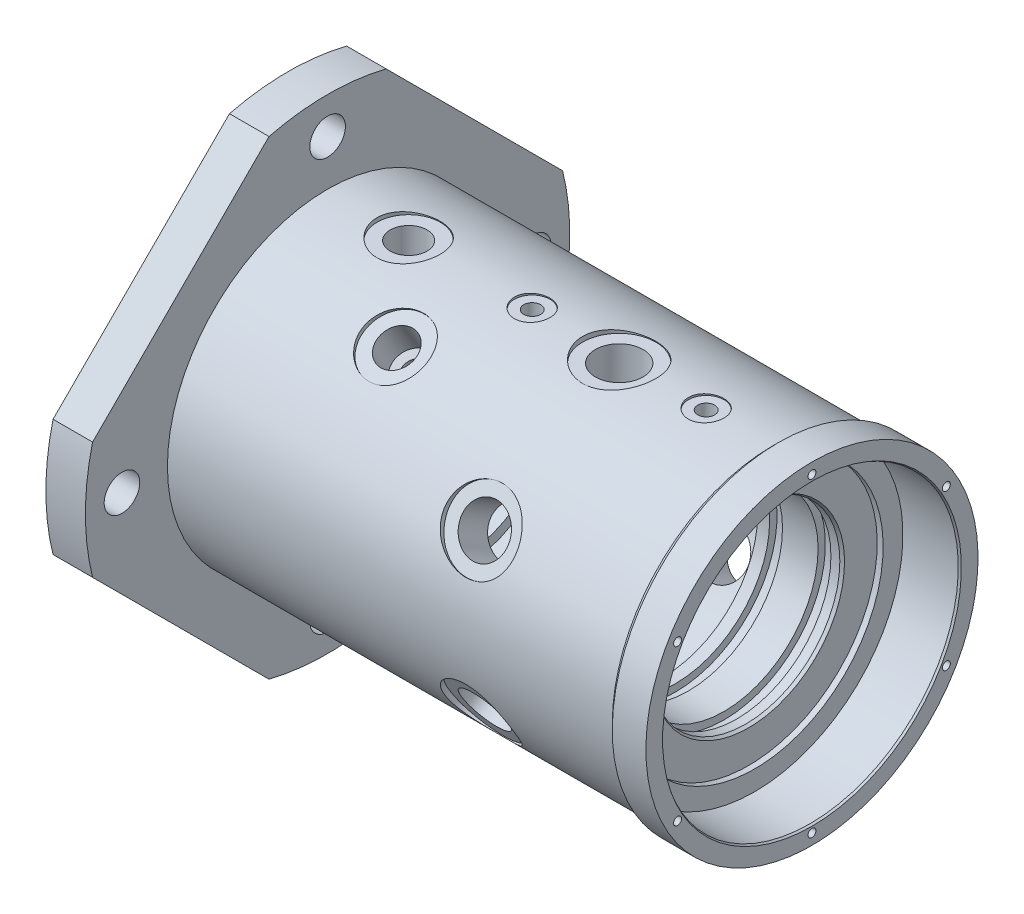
from build123d import *

# Parameters (mm, degrees)
F_1ER_18_D                    = 18
PATTERN_CIRCULAR_4_X_18_COUNT = 4
F_6_X_M5_COUNT                = 6
F_1ER_PLAT_DEPTH              = 301.062493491
F_4_PLATS_COUNT               = 4
PATTERN_LINEAR_D2_COUNT       = 2
PATTERN_LINEAR_D2_PITCH       = 88
F_6_X_3_4_G_COUNT             = 6


with BuildPart() as part:
    # Esquisse1 → profil (revolve)
    with BuildSketch(Plane.XY):
        Polygon((-258.17244139, 47.6), (-253.67244139, 47.6), (-253.67244139, 51.3), (-247.17244139, 51.3), (-247.17244139, 47.6), (-241.17244139, 47.6), (-241.17244139, 52.5), (-226.17244139, 52.5), (-226.17244139, 47.6), (-220.17244139, 47.6), (-220.17244139, 51.3), (-213.67244139, 51.3), (-213.67244139, 47.6), (-207.67244139, 47.6), (-207.67244139, 52.5), (-192.67244139, 52.5), (-192.67244139, 47.6), (-186.67244139, 47.6), (-186.67244139, 51.3), (-180.17244139, 51.3), (-180.17244139, 47.6), (-162.17244139, 47.6), (-162.17244139, 51.3), (-155.67244139, 51.3), (-155.67244139, 47.6), (-149.67244139, 47.6), (-149.67244139, 61.5), (-104.67244139, 61.5), (-104.67244139, 47.6), (-98.67244139, 47.6), (-98.67244139, 51.3), (-92.17244139, 51.3), (-92.17244139, 47.6), (-74.17244139, 47.6), (-74.17244139, 51.3), (-67.67244139, 51.3), (-67.67244139, 47.6), (-63.17244139, 47.6), (-61.67244139, 48.466025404), (-61.67244139, 65), (-58.67244139, 65), (-58.67244139, 75), (-30.67244139, 75), (-29.67244139, 75.577350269), (-29.67244139, 84), (-46.67244139, 84), (-49.67244139, 81), (-274.67244139, 81), (-274.67244139, 122.5), (-294.67244139, 122.5), (-294.67244139, 70.866025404), (-293.17244139, 70), (-288.82244139, 70), (-288.82244139, 72), (-284.67244139, 72), (-284.67244139, 70), (-260.67244139, 70), (-260.67244139, 60), (-259.67244139, 60), (-259.67244139, 48.466025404), align=None)
    revolve(axis=Axis((0, 0, 0), (-1, 0, 0)))

    # 1er _ 18 (through all)
    with Locations(Plane(origin=(-274.67244139, 0, 0), x_dir=(0, 0, -1), z_dir=(1, 0, 0))):
        with Locations((0, 104)):
            f_1er_18 = Hole(F_1ER_18_D / 2)

    # Pattern Circular 4 x _ 18: 1er _ 18 ×4 about axis
    pattern_circular_4_x_18_axis = Axis((0, 0, 0), (1, 0, 0))
    for i in range(1, PATTERN_CIRCULAR_4_X_18_COUNT):
        add(f_1er_18.rotate(pattern_circular_4_x_18_axis, i * 360 / PATTERN_CIRCULAR_4_X_18_COUNT), mode=Mode.SUBTRACT)

    # Esquisse5 → 1er M5 (revolve, cut)
    with BuildSketch(Plane(origin=(-29.67244139, 78.5, 0), x_dir=(0, 0, -1), z_dir=(0, 1, 0))):
        Polygon((0, 0), (0, 14.159896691), (2.009, 13), (2.009, 0), align=None)
    f_1er_m5 = revolve(axis=Axis((-23.32244139, 78.5, 0), (-1, 0, 0)), mode=Mode.SUBTRACT)

    # 6 x M5: 1er M5 ×6 about axis
    f_6_x_m5_axis = Axis((0, 0, 0), (1, 0, 0))
    for i in range(1, F_6_X_M5_COUNT):
        add(f_1er_m5.rotate(f_6_x_m5_axis, i * 360 / F_6_X_M5_COUNT), mode=Mode.SUBTRACT)

    # Esquisse7 → 1er plat (cut, through all)
    with BuildSketch(Plane(origin=(-274.67244139, 0, 0), x_dir=(0, 0, -1), z_dir=(1, 0, 0))):
        Polygon((7.349006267, 141.143417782), (132.850314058, 15.642109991), (164.55003686, 47.341832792), (39.048729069, 172.843140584), align=None)
    f_1er_plat = extrude(amount=-F_1ER_PLAT_DEPTH, mode=Mode.SUBTRACT)

    # 4 plats: 1er plat ×4 about axis
    f_4_plats_axis = Axis((0, 0, 0), (1, 0, 0))
    for i in range(1, F_4_PLATS_COUNT):
        add(f_1er_plat.rotate(f_4_plats_axis, i * 360 / F_4_PLATS_COUNT), mode=Mode.SUBTRACT)

    # Esquisse8 → Cut-Revolve D1 (revolve, cut)
    with BuildSketch(Plane(origin=(-83.17244139, 0, 0), x_dir=(0, 0, -1), z_dir=(1, 0, 0)), mode=Mode.PRIVATE) as cut_revolve_d1_sk:
        Polygon((0, 81), (-9, 81), (-9, 80), (-4.283, 80), (-4.283, 70), (-3, 69.259259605), (-3, 39.71042213), (0, 39.71042213), align=None)
    cut_revolve_d1 = revolve(cut_revolve_d1_sk.sketch.rotate(Axis((-83.17244139, 92.154545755, 0), (0, -1, 0)), 90), axis=Axis((-83.17244139, 92.154545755, 0), (0, -1, 0)), mode=Mode.SUBTRACT)

    # Pattern Linear D2: Cut-Revolve D1 ×2
    with Locations(*[(-i * PATTERN_LINEAR_D2_PITCH, 0, 0) for i in range(1, PATTERN_LINEAR_D2_COUNT)]):
        add(cut_revolve_d1, mode=Mode.SUBTRACT)

    # Esquisse9 → cir 1A (revolve, cut)
    with BuildSketch(Plane(origin=(-127.17244139, 0, 0), x_dir=(0, 0, -1), z_dir=(1, 0, 0)), mode=Mode.PRIVATE) as cir_1a_sk:
        Polygon((0, 81), (-18.5, 81), (-18.5, 78.5), (-12.0585, 78.5), (-12.0585, 39.004960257), (0, 39.004960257), align=None)
    cir_1a = revolve(cir_1a_sk.sketch.rotate(Axis((-127.17244139, 0, 0), (0, 1, 0)), 180), axis=Axis((-127.17244139, 0, 0), (0, 1, 0)), mode=Mode.SUBTRACT)

    # Esquisse10 → cir 2 (revolve, cut)
    with BuildSketch(Plane(origin=(-200.17244139, 0, 0), x_dir=(0, 0, -1), z_dir=(1, 0, 0))):
        Polygon((-40.5, 70.148057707), (-54.356406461, 62.148057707), (-53.356406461, 60.416006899), (-47.567459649, 63.758256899), (-39.567459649, 49.901850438), (-35.739050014, 49.901850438), (-24.930792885, 31.181399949), (-19.734640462, 34.181399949), align=None)
    revolve(axis=Axis((-200.17244139, 82.622934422, 47.70237343), (0, -0.8660254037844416, -0.49999999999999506)), mode=Mode.SUBTRACT)

    # Esquisse11 → cir 3 (revolve, cut)
    with BuildSketch(Plane(origin=(-233.67244139, 0, 0), x_dir=(0, 0, -1), z_dir=(1, 0, 0))):
        Polygon((0, 81), (-16, 81), (-16, 79), (-9.3155, 79), (-9.3155, 63), (-6, 61.085795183), (-6, 35.550213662), (0, 35.550213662), align=None)
    revolve(axis=Axis((-233.67244139, 90.665665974, 0), (0, -1, 0)), mode=Mode.SUBTRACT)

    # 6 x _ 3_4_G: cir 1A ×6 about axis
    f_6_x_3_4_g_axis = Axis((0, 0, 0), (1, 0, 0))
    for i in range(1, F_6_X_3_4_G_COUNT):
        add(cir_1a.rotate(f_6_x_3_4_g_axis, i * 360 / F_6_X_3_4_G_COUNT), mode=Mode.SUBTRACT)


solid = part.part
